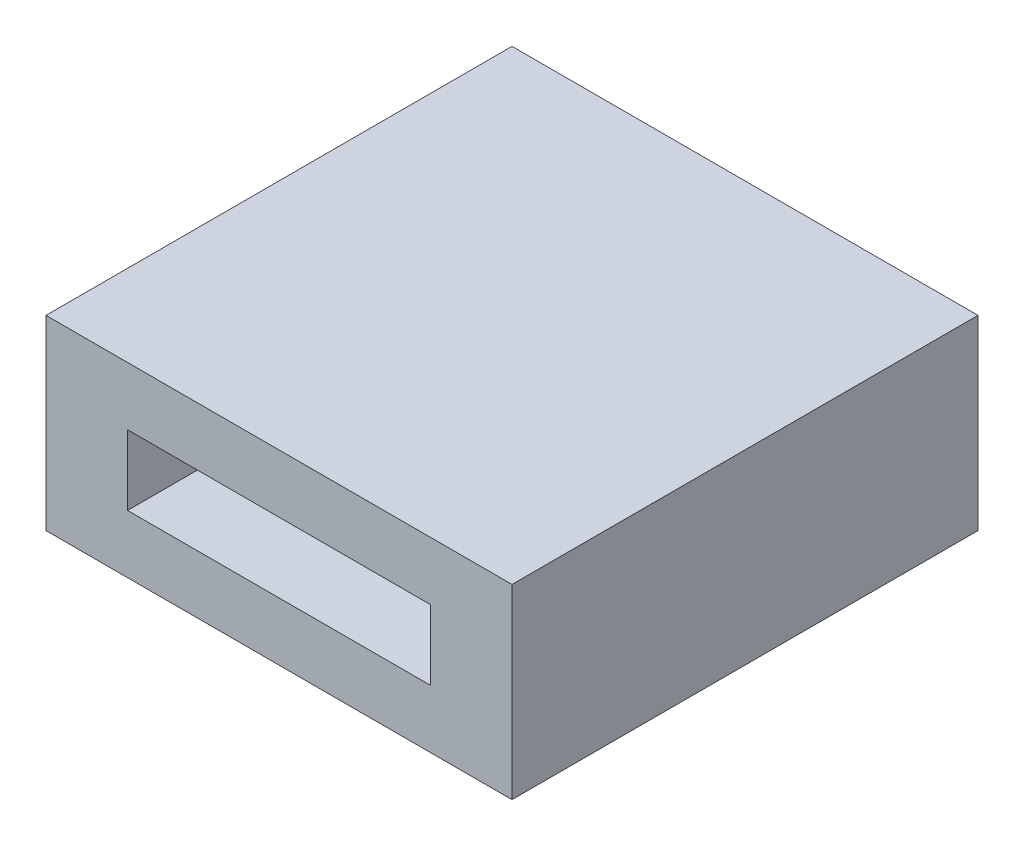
ISO-10303-21;
HEADER;
FILE_DESCRIPTION(('STEP AP214'),'2;1');
FILE_NAME('part.step','',(''),(''),'','','');
FILE_SCHEMA(('AUTOMOTIVE_DESIGN { 1 0 10303 214 1 1 1 1 }'));
ENDSEC;
DATA;
#1=APPLICATION_CONTEXT('core data for automotive mechanical design processes');
#2=APPLICATION_PROTOCOL_DEFINITION('international standard','automotive_design',2000,#1);
#3=PRODUCT_CONTEXT('',#1,'mechanical');
#4=PRODUCT('Part','Part','',(#3));
#5=PRODUCT_RELATED_PRODUCT_CATEGORY('part','',(#4));
#6=PRODUCT_DEFINITION_FORMATION('','',#4);
#7=PRODUCT_DEFINITION_CONTEXT('part definition',#1,'design');
#8=PRODUCT_DEFINITION('design','',#6,#7);
#9=PRODUCT_DEFINITION_SHAPE('','',#8);
#10=(LENGTH_UNIT() NAMED_UNIT(*) SI_UNIT(.MILLI.,.METRE.));
#11=(NAMED_UNIT(*) PLANE_ANGLE_UNIT() SI_UNIT($,.RADIAN.));
#12=(NAMED_UNIT(*) SI_UNIT($,.STERADIAN.) SOLID_ANGLE_UNIT());
#13=UNCERTAINTY_MEASURE_WITH_UNIT(LENGTH_MEASURE(1.E-05),#10,'distance_accuracy_value','');
#14=(GEOMETRIC_REPRESENTATION_CONTEXT(3) GLOBAL_UNCERTAINTY_ASSIGNED_CONTEXT((#13)) GLOBAL_UNIT_ASSIGNED_CONTEXT((#10,
#11,#12)) REPRESENTATION_CONTEXT('',''));
#15=CARTESIAN_POINT('',(0.,0.,0.));
#16=DIRECTION('',(0.,0.,1.));
#17=DIRECTION('',(1.,0.,0.));
#18=AXIS2_PLACEMENT_3D('',#15,#16,#17);
#19=CARTESIAN_POINT('',(-17.7600143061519,2.03200000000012,5.08000000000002));
#20=DIRECTION('',(1.00000000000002,0.,0.));
#21=DIRECTION('',(0.,0.,-1.));
#22=AXIS2_PLACEMENT_3D('',#19,#20,#21);
#23=PLANE('',#22);
#24=DIRECTION('',(0.,-1.,0.));
#25=VECTOR('',#24,1.);
#26=CARTESIAN_POINT('',(-17.7600143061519,2.03200000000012,0.));
#27=LINE('',#26,#25);
#28=CARTESIAN_POINT('',(-17.7600143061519,2.03200000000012,0.));
#29=VERTEX_POINT('',#28);
#30=CARTESIAN_POINT('',(-17.7600143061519,1.17961196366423E-13,0.));
#31=VERTEX_POINT('',#30);
#32=EDGE_CURVE('E133',#29,#31,#27,.T.);
#33=ORIENTED_EDGE('',*,*,#32,.T.);
#34=DIRECTION('',(0.,0.,-1.));
#35=VECTOR('',#34,1.);
#36=CARTESIAN_POINT('',(-17.7600143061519,1.17961196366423E-13,5.08000000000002));
#37=LINE('',#36,#35);
#38=CARTESIAN_POINT('',(-17.7600143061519,1.17961196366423E-13,5.08000000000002));
#39=VERTEX_POINT('',#38);
#40=EDGE_CURVE('E11',#39,#31,#37,.T.);
#41=ORIENTED_EDGE('',*,*,#40,.F.);
#42=DIRECTION('',(0.,-1.,0.));
#43=VECTOR('',#42,1.);
#44=CARTESIAN_POINT('',(-17.7600143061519,2.03200000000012,5.08000000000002));
#45=LINE('',#44,#43);
#46=CARTESIAN_POINT('',(-17.7600143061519,2.03200000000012,5.08000000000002));
#47=VERTEX_POINT('',#46);
#48=EDGE_CURVE('E144',#47,#39,#45,.T.);
#49=ORIENTED_EDGE('',*,*,#48,.F.);
#50=DIRECTION('',(0.,0.,-1.));
#51=VECTOR('',#50,1.);
#52=CARTESIAN_POINT('',(-17.7600143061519,2.03200000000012,5.08000000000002));
#53=LINE('',#52,#51);
#54=EDGE_CURVE('E151',#47,#29,#53,.T.);
#55=ORIENTED_EDGE('',*,*,#54,.T.);
#56=EDGE_LOOP('',(#33,#41,#49,#55));
#57=FACE_BOUND('',#56,.T.);
#58=ADVANCED_FACE('F31',(#57),#23,.F.);
#59=CARTESIAN_POINT('',(-17.7600143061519,1.17961196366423E-13,5.08000000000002));
#60=DIRECTION('',(0.,1.,0.));
#61=DIRECTION('',(0.,0.,1.));
#62=AXIS2_PLACEMENT_3D('',#59,#60,#61);
#63=PLANE('',#62);
#64=DIRECTION('',(1.00000000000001,0.,0.));
#65=VECTOR('',#64,1.);
#66=CARTESIAN_POINT('',(-17.7600143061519,1.17961196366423E-13,0.));
#67=LINE('',#66,#65);
#68=CARTESIAN_POINT('',(-12.6800143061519,3.40005801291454E-13,0.));
#69=VERTEX_POINT('',#68);
#70=EDGE_CURVE('E138',#31,#69,#67,.T.);
#71=ORIENTED_EDGE('',*,*,#70,.T.);
#72=DIRECTION('',(0.,0.,-1.));
#73=VECTOR('',#72,1.);
#74=CARTESIAN_POINT('',(-12.6800143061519,3.40005801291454E-13,5.08000000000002));
#75=LINE('',#74,#73);
#76=CARTESIAN_POINT('',(-12.6800143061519,3.40005801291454E-13,5.08000000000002));
#77=VERTEX_POINT('',#76);
#78=EDGE_CURVE('E38',#77,#69,#75,.T.);
#79=ORIENTED_EDGE('',*,*,#78,.F.);
#80=DIRECTION('',(1.00000000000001,0.,0.));
#81=VECTOR('',#80,1.);
#82=CARTESIAN_POINT('',(-17.7600143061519,1.17961196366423E-13,5.08000000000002));
#83=LINE('',#82,#81);
#84=EDGE_CURVE('E146',#39,#77,#83,.T.);
#85=ORIENTED_EDGE('',*,*,#84,.F.);
#86=ORIENTED_EDGE('',*,*,#40,.T.);
#87=EDGE_LOOP('',(#71,#79,#85,#86));
#88=FACE_BOUND('',#87,.T.);
#89=ADVANCED_FACE('F173',(#88),#63,.F.);
#90=CARTESIAN_POINT('',(-12.6800143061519,2.03200000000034,5.08000000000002));
#91=DIRECTION('',(-1.00000000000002,0.,0.));
#92=DIRECTION('',(0.,-1.,0.));
#93=AXIS2_PLACEMENT_3D('',#90,#91,#92);
#94=PLANE('',#93);
#95=DIRECTION('',(0.,1.,0.));
#96=VECTOR('',#95,1.);
#97=CARTESIAN_POINT('',(-12.6800143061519,2.03200000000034,0.));
#98=LINE('',#97,#96);
#99=CARTESIAN_POINT('',(-12.6800143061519,2.03200000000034,0.));
#100=VERTEX_POINT('',#99);
#101=EDGE_CURVE('E140',#69,#100,#98,.T.);
#102=ORIENTED_EDGE('',*,*,#101,.T.);
#103=DIRECTION('',(0.,0.,-1.));
#104=VECTOR('',#103,1.);
#105=CARTESIAN_POINT('',(-12.6800143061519,2.03200000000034,5.08000000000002));
#106=LINE('',#105,#104);
#107=CARTESIAN_POINT('',(-12.6800143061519,2.03200000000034,5.08000000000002));
#108=VERTEX_POINT('',#107);
#109=EDGE_CURVE('E154',#108,#100,#106,.T.);
#110=ORIENTED_EDGE('',*,*,#109,.F.);
#111=DIRECTION('',(0.,1.,0.));
#112=VECTOR('',#111,1.);
#113=CARTESIAN_POINT('',(-12.6800143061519,2.03200000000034,5.08000000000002));
#114=LINE('',#113,#112);
#115=EDGE_CURVE('E148',#77,#108,#114,.T.);
#116=ORIENTED_EDGE('',*,*,#115,.F.);
#117=ORIENTED_EDGE('',*,*,#78,.T.);
#118=EDGE_LOOP('',(#102,#110,#116,#117));
#119=FACE_BOUND('',#118,.T.);
#120=ADVANCED_FACE('F161',(#119),#94,.F.);
#121=CARTESIAN_POINT('',(-17.7600143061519,2.03200000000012,5.08000000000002));
#122=DIRECTION('',(0.,-1.,0.));
#123=DIRECTION('',(0.,0.,-1.));
#124=AXIS2_PLACEMENT_3D('',#121,#122,#123);
#125=PLANE('',#124);
#126=DIRECTION('',(-1.00000000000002,0.,0.));
#127=VECTOR('',#126,1.);
#128=CARTESIAN_POINT('',(-17.7600143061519,2.03200000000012,0.));
#129=LINE('',#128,#127);
#130=EDGE_CURVE('E142',#100,#29,#129,.T.);
#131=ORIENTED_EDGE('',*,*,#130,.T.);
#132=ORIENTED_EDGE('',*,*,#54,.F.);
#133=DIRECTION('',(-1.00000000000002,0.,0.));
#134=VECTOR('',#133,1.);
#135=CARTESIAN_POINT('',(-17.7600143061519,2.03200000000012,5.08000000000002));
#136=LINE('',#135,#134);
#137=EDGE_CURVE('E53',#108,#47,#136,.T.);
#138=ORIENTED_EDGE('',*,*,#137,.F.);
#139=ORIENTED_EDGE('',*,*,#109,.T.);
#140=EDGE_LOOP('',(#131,#132,#138,#139));
#141=FACE_BOUND('',#140,.T.);
#142=ADVANCED_FACE('F169',(#141),#125,.F.);
#143=CARTESIAN_POINT('',(-17.7600143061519,1.17961196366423E-13,5.08000000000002));
#144=DIRECTION('',(0.,0.,1.));
#145=DIRECTION('',(1.00000000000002,0.,0.));
#146=AXIS2_PLACEMENT_3D('',#143,#144,#145);
#147=PLANE('',#146);
#148=DIRECTION('',(0.,-1.,0.));
#149=VECTOR('',#148,1.);
#150=CARTESIAN_POINT('',(-16.8710143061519,1.39700000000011,5.08000000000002));
#151=LINE('',#150,#149);
#152=CARTESIAN_POINT('',(-16.8710143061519,1.39700000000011,5.08000000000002));
#153=VERTEX_POINT('',#152);
#154=CARTESIAN_POINT('',(-16.8710143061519,0.635000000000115,5.08000000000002));
#155=VERTEX_POINT('',#154);
#156=EDGE_CURVE('E45',#153,#155,#151,.T.);
#157=ORIENTED_EDGE('',*,*,#156,.F.);
#158=DIRECTION('',(-1.00000000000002,0.,0.));
#159=VECTOR('',#158,1.);
#160=CARTESIAN_POINT('',(-16.8710143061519,1.39700000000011,5.08000000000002));
#161=LINE('',#160,#159);
#162=CARTESIAN_POINT('',(-13.5690143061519,1.39700000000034,5.08000000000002));
#163=VERTEX_POINT('',#162);
#164=EDGE_CURVE('E117',#163,#153,#161,.T.);
#165=ORIENTED_EDGE('',*,*,#164,.F.);
#166=DIRECTION('',(0.,1.,0.));
#167=VECTOR('',#166,1.);
#168=CARTESIAN_POINT('',(-13.5690143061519,1.39700000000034,5.08000000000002));
#169=LINE('',#168,#167);
#170=CARTESIAN_POINT('',(-13.5690143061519,0.635000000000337,5.08000000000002));
#171=VERTEX_POINT('',#170);
#172=EDGE_CURVE('E100',#171,#163,#169,.T.);
#173=ORIENTED_EDGE('',*,*,#172,.F.);
#174=DIRECTION('',(1.00000000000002,0.,0.));
#175=VECTOR('',#174,1.);
#176=CARTESIAN_POINT('',(-16.8710143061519,0.635000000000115,5.08000000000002));
#177=LINE('',#176,#175);
#178=EDGE_CURVE('E111',#155,#171,#177,.T.);
#179=ORIENTED_EDGE('',*,*,#178,.F.);
#180=EDGE_LOOP('',(#157,#165,#173,#179));
#181=FACE_BOUND('',#180,.T.);
#182=ORIENTED_EDGE('',*,*,#48,.T.);
#183=ORIENTED_EDGE('',*,*,#84,.T.);
#184=ORIENTED_EDGE('',*,*,#115,.T.);
#185=ORIENTED_EDGE('',*,*,#137,.T.);
#186=EDGE_LOOP('',(#182,#183,#184,#185));
#187=FACE_BOUND('',#186,.T.);
#188=ADVANCED_FACE('F115',(#181,#187),#147,.T.);
#189=CARTESIAN_POINT('',(-17.7600143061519,1.17961196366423E-13,0.));
#190=DIRECTION('',(0.,0.,1.));
#191=DIRECTION('',(1.00000000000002,0.,0.));
#192=AXIS2_PLACEMENT_3D('',#189,#190,#191);
#193=PLANE('',#192);
#194=ORIENTED_EDGE('',*,*,#32,.F.);
#195=ORIENTED_EDGE('',*,*,#130,.F.);
#196=ORIENTED_EDGE('',*,*,#101,.F.);
#197=ORIENTED_EDGE('',*,*,#70,.F.);
#198=EDGE_LOOP('',(#194,#195,#196,#197));
#199=FACE_BOUND('',#198,.T.);
#200=ADVANCED_FACE('F167',(#199),#193,.F.);
#201=CARTESIAN_POINT('',(-16.8710143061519,1.39700000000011,0.508000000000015));
#202=DIRECTION('',(-1.00000000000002,0.,0.));
#203=DIRECTION('',(0.,0.,1.));
#204=AXIS2_PLACEMENT_3D('',#201,#202,#203);
#205=PLANE('',#204);
#206=ORIENTED_EDGE('',*,*,#156,.T.);
#207=DIRECTION('',(0.,0.,1.));
#208=VECTOR('',#207,1.);
#209=CARTESIAN_POINT('',(-16.8710143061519,0.635000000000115,0.508000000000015));
#210=LINE('',#209,#208);
#211=CARTESIAN_POINT('',(-16.8710143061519,0.635000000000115,0.508000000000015));
#212=VERTEX_POINT('',#211);
#213=EDGE_CURVE('E108',#212,#155,#210,.T.);
#214=ORIENTED_EDGE('',*,*,#213,.F.);
#215=DIRECTION('',(0.,-1.,0.));
#216=VECTOR('',#215,1.);
#217=CARTESIAN_POINT('',(-16.8710143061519,1.39700000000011,0.508000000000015));
#218=LINE('',#217,#216);
#219=CARTESIAN_POINT('',(-16.8710143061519,1.39700000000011,0.508000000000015));
#220=VERTEX_POINT('',#219);
#221=EDGE_CURVE('E119',#220,#212,#218,.T.);
#222=ORIENTED_EDGE('',*,*,#221,.F.);
#223=DIRECTION('',(0.,0.,1.));
#224=VECTOR('',#223,1.);
#225=CARTESIAN_POINT('',(-16.8710143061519,1.39700000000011,0.508000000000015));
#226=LINE('',#225,#224);
#227=EDGE_CURVE('E131',#220,#153,#226,.T.);
#228=ORIENTED_EDGE('',*,*,#227,.T.);
#229=EDGE_LOOP('',(#206,#214,#222,#228));
#230=FACE_BOUND('',#229,.T.);
#231=ADVANCED_FACE('F187',(#230),#205,.F.);
#232=CARTESIAN_POINT('',(-16.8710143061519,1.39700000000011,0.508000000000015));
#233=DIRECTION('',(0.,1.,0.));
#234=DIRECTION('',(0.,0.,1.));
#235=AXIS2_PLACEMENT_3D('',#232,#233,#234);
#236=PLANE('',#235);
#237=ORIENTED_EDGE('',*,*,#164,.T.);
#238=ORIENTED_EDGE('',*,*,#227,.F.);
#239=DIRECTION('',(-1.00000000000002,0.,0.));
#240=VECTOR('',#239,1.);
#241=CARTESIAN_POINT('',(-16.8710143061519,1.39700000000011,0.508000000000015));
#242=LINE('',#241,#240);
#243=CARTESIAN_POINT('',(-13.5690143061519,1.39700000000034,0.508000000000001));
#244=VERTEX_POINT('',#243);
#245=EDGE_CURVE('E128',#244,#220,#242,.T.);
#246=ORIENTED_EDGE('',*,*,#245,.F.);
#247=DIRECTION('',(0.,0.,1.));
#248=VECTOR('',#247,1.);
#249=CARTESIAN_POINT('',(-13.5690143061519,1.39700000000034,0.508000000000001));
#250=LINE('',#249,#248);
#251=EDGE_CURVE('E107',#244,#163,#250,.T.);
#252=ORIENTED_EDGE('',*,*,#251,.T.);
#253=EDGE_LOOP('',(#237,#238,#246,#252));
#254=FACE_BOUND('',#253,.T.);
#255=ADVANCED_FACE('F190',(#254),#236,.F.);
#256=CARTESIAN_POINT('',(-13.5690143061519,1.39700000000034,0.508000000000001));
#257=DIRECTION('',(1.00000000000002,0.,0.));
#258=DIRECTION('',(0.,0.,-1.));
#259=AXIS2_PLACEMENT_3D('',#256,#257,#258);
#260=PLANE('',#259);
#261=ORIENTED_EDGE('',*,*,#172,.T.);
#262=ORIENTED_EDGE('',*,*,#251,.F.);
#263=DIRECTION('',(0.,1.,0.));
#264=VECTOR('',#263,1.);
#265=CARTESIAN_POINT('',(-13.5690143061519,1.39700000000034,0.508000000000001));
#266=LINE('',#265,#264);
#267=CARTESIAN_POINT('',(-13.5690143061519,0.635000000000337,0.508000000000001));
#268=VERTEX_POINT('',#267);
#269=EDGE_CURVE('E103',#268,#244,#266,.T.);
#270=ORIENTED_EDGE('',*,*,#269,.F.);
#271=DIRECTION('',(0.,0.,1.));
#272=VECTOR('',#271,1.);
#273=CARTESIAN_POINT('',(-13.5690143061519,0.635000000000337,0.508000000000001));
#274=LINE('',#273,#272);
#275=EDGE_CURVE('E96',#268,#171,#274,.T.);
#276=ORIENTED_EDGE('',*,*,#275,.T.);
#277=EDGE_LOOP('',(#261,#262,#270,#276));
#278=FACE_BOUND('',#277,.T.);
#279=ADVANCED_FACE('F98',(#278),#260,.F.);
#280=CARTESIAN_POINT('',(-16.8710143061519,0.635000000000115,0.508000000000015));
#281=DIRECTION('',(0.,-1.,0.));
#282=DIRECTION('',(0.,0.,-1.));
#283=AXIS2_PLACEMENT_3D('',#280,#281,#282);
#284=PLANE('',#283);
#285=ORIENTED_EDGE('',*,*,#178,.T.);
#286=ORIENTED_EDGE('',*,*,#275,.F.);
#287=DIRECTION('',(1.00000000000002,0.,0.));
#288=VECTOR('',#287,1.);
#289=CARTESIAN_POINT('',(-16.8710143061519,0.635000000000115,0.508000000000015));
#290=LINE('',#289,#288);
#291=EDGE_CURVE('E125',#212,#268,#290,.T.);
#292=ORIENTED_EDGE('',*,*,#291,.F.);
#293=ORIENTED_EDGE('',*,*,#213,.T.);
#294=EDGE_LOOP('',(#285,#286,#292,#293));
#295=FACE_BOUND('',#294,.T.);
#296=ADVANCED_FACE('F112',(#295),#284,.F.);
#297=CARTESIAN_POINT('',(-16.8710143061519,0.635000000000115,0.508000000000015));
#298=DIRECTION('',(0.,0.,1.));
#299=DIRECTION('',(1.00000000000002,0.,0.));
#300=AXIS2_PLACEMENT_3D('',#297,#298,#299);
#301=PLANE('',#300);
#302=ORIENTED_EDGE('',*,*,#221,.T.);
#303=ORIENTED_EDGE('',*,*,#291,.T.);
#304=ORIENTED_EDGE('',*,*,#269,.T.);
#305=ORIENTED_EDGE('',*,*,#245,.T.);
#306=EDGE_LOOP('',(#302,#303,#304,#305));
#307=FACE_BOUND('',#306,.T.);
#308=ADVANCED_FACE('F193',(#307),#301,.T.);
#309=CLOSED_SHELL('',(#58,#89,#120,#142,#188,#200,#231,#255,#279,#296,#308));
#310=MANIFOLD_SOLID_BREP('B2',#309);
#311=ADVANCED_BREP_SHAPE_REPRESENTATION('',(#18,#310),#14);
#312=SHAPE_DEFINITION_REPRESENTATION(#9,#311);
ENDSEC;
END-ISO-10303-21;
